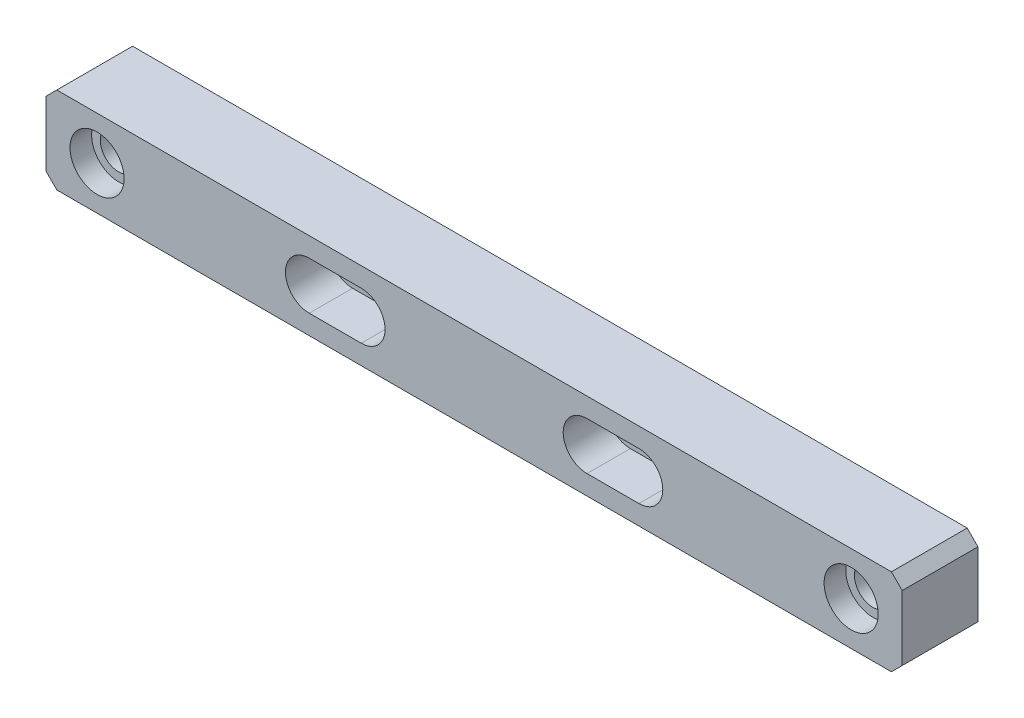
ISO-10303-21;
HEADER;
FILE_DESCRIPTION(('STEP AP214'),'2;1');
FILE_NAME('part.step','',(''),(''),'','','');
FILE_SCHEMA(('AUTOMOTIVE_DESIGN { 1 0 10303 214 1 1 1 1 }'));
ENDSEC;
DATA;
#1=APPLICATION_CONTEXT('core data for automotive mechanical design processes');
#2=APPLICATION_PROTOCOL_DEFINITION('international standard','automotive_design',2000,#1);
#3=PRODUCT_CONTEXT('',#1,'mechanical');
#4=PRODUCT('Part','Part','',(#3));
#5=PRODUCT_RELATED_PRODUCT_CATEGORY('part','',(#4));
#6=PRODUCT_DEFINITION_FORMATION('','',#4);
#7=PRODUCT_DEFINITION_CONTEXT('part definition',#1,'design');
#8=PRODUCT_DEFINITION('design','',#6,#7);
#9=PRODUCT_DEFINITION_SHAPE('','',#8);
#10=(LENGTH_UNIT() NAMED_UNIT(*) SI_UNIT(.MILLI.,.METRE.));
#11=(NAMED_UNIT(*) PLANE_ANGLE_UNIT() SI_UNIT($,.RADIAN.));
#12=(NAMED_UNIT(*) SI_UNIT($,.STERADIAN.) SOLID_ANGLE_UNIT());
#13=UNCERTAINTY_MEASURE_WITH_UNIT(LENGTH_MEASURE(1.E-05),#10,'distance_accuracy_value','');
#14=(GEOMETRIC_REPRESENTATION_CONTEXT(3) GLOBAL_UNCERTAINTY_ASSIGNED_CONTEXT((#13)) GLOBAL_UNIT_ASSIGNED_CONTEXT((#10,
#11,#12)) REPRESENTATION_CONTEXT('',''));
#15=CARTESIAN_POINT('',(0.,0.,0.));
#16=DIRECTION('',(0.,0.,1.));
#17=DIRECTION('',(1.,0.,0.));
#18=AXIS2_PLACEMENT_3D('',#15,#16,#17);
#19=CARTESIAN_POINT('',(68.9816494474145,-291.474223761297,91.585728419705));
#20=DIRECTION('',(-1.,0.,0.));
#21=DIRECTION('',(0.,0.,1.));
#22=AXIS2_PLACEMENT_3D('',#19,#20,#21);
#23=PLANE('',#22);
#24=DIRECTION('',(0.,-1.,0.));
#25=VECTOR('',#24,1.);
#26=CARTESIAN_POINT('',(68.9816494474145,-291.474223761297,126.585728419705));
#27=LINE('',#26,#25);
#28=CARTESIAN_POINT('',(68.9816494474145,-296.474223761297,126.585728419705));
#29=VERTEX_POINT('',#28);
#30=CARTESIAN_POINT('',(68.9816494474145,-326.474223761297,126.585728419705));
#31=VERTEX_POINT('',#30);
#32=EDGE_CURVE('E219',#29,#31,#27,.T.);
#33=ORIENTED_EDGE('',*,*,#32,.T.);
#34=DIRECTION('',(0.,0.,-1.));
#35=VECTOR('',#34,1.);
#36=CARTESIAN_POINT('',(68.9816494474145,-326.474223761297,91.585728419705));
#37=LINE('',#36,#35);
#38=CARTESIAN_POINT('',(68.9816494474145,-326.474223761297,91.585728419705));
#39=VERTEX_POINT('',#38);
#40=EDGE_CURVE('E11',#31,#39,#37,.T.);
#41=ORIENTED_EDGE('',*,*,#40,.T.);
#42=DIRECTION('',(0.,-1.,0.));
#43=VECTOR('',#42,1.);
#44=CARTESIAN_POINT('',(68.9816494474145,-291.474223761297,91.585728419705));
#45=LINE('',#44,#43);
#46=CARTESIAN_POINT('',(68.9816494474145,-296.474223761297,91.585728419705));
#47=VERTEX_POINT('',#46);
#48=EDGE_CURVE('E226',#47,#39,#45,.T.);
#49=ORIENTED_EDGE('',*,*,#48,.F.);
#50=DIRECTION('',(0.,0.,1.));
#51=VECTOR('',#50,1.);
#52=CARTESIAN_POINT('',(68.9816494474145,-296.474223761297,91.585728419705));
#53=LINE('',#52,#51);
#54=EDGE_CURVE('E41',#47,#29,#53,.T.);
#55=ORIENTED_EDGE('',*,*,#54,.T.);
#56=EDGE_LOOP('',(#33,#41,#49,#55));
#57=FACE_BOUND('',#56,.T.);
#58=ADVANCED_FACE('F33',(#57),#23,.F.);
#59=CARTESIAN_POINT('',(68.9816494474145,-331.474223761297,91.585728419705));
#60=DIRECTION('',(0.,1.,0.));
#61=DIRECTION('',(0.,0.,1.));
#62=AXIS2_PLACEMENT_3D('',#59,#60,#61);
#63=PLANE('',#62);
#64=DIRECTION('',(-1.,0.,0.));
#65=VECTOR('',#64,1.);
#66=CARTESIAN_POINT('',(68.9816494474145,-331.474223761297,126.585728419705));
#67=LINE('',#66,#65);
#68=CARTESIAN_POINT('',(63.9816494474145,-331.474223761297,126.585728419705));
#69=VERTEX_POINT('',#68);
#70=CARTESIAN_POINT('',(-321.422143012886,-331.474223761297,126.585728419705));
#71=VERTEX_POINT('',#70);
#72=EDGE_CURVE('E240',#69,#71,#67,.T.);
#73=ORIENTED_EDGE('',*,*,#72,.T.);
#74=DIRECTION('',(0.,0.,-1.));
#75=VECTOR('',#74,1.);
#76=CARTESIAN_POINT('',(-321.422143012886,-331.474223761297,91.585728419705));
#77=LINE('',#76,#75);
#78=CARTESIAN_POINT('',(-321.422143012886,-331.474223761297,91.585728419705));
#79=VERTEX_POINT('',#78);
#80=EDGE_CURVE('E268',#71,#79,#77,.T.);
#81=ORIENTED_EDGE('',*,*,#80,.T.);
#82=DIRECTION('',(-1.,0.,0.));
#83=VECTOR('',#82,1.);
#84=CARTESIAN_POINT('',(68.9816494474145,-331.474223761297,91.585728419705));
#85=LINE('',#84,#83);
#86=CARTESIAN_POINT('',(63.9816494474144,-331.474223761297,91.585728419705));
#87=VERTEX_POINT('',#86);
#88=EDGE_CURVE('E229',#87,#79,#85,.T.);
#89=ORIENTED_EDGE('',*,*,#88,.F.);
#90=DIRECTION('',(0.,0.,1.));
#91=VECTOR('',#90,1.);
#92=CARTESIAN_POINT('',(63.9816494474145,-331.474223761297,91.585728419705));
#93=LINE('',#92,#91);
#94=EDGE_CURVE('E265',#87,#69,#93,.T.);
#95=ORIENTED_EDGE('',*,*,#94,.T.);
#96=EDGE_LOOP('',(#73,#81,#89,#95));
#97=FACE_BOUND('',#96,.T.);
#98=ADVANCED_FACE('F299',(#97),#63,.F.);
#99=CARTESIAN_POINT('',(-326.422143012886,-291.474223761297,91.585728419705));
#100=DIRECTION('',(1.,0.,0.));
#101=DIRECTION('',(0.,0.,-1.));
#102=AXIS2_PLACEMENT_3D('',#99,#100,#101);
#103=PLANE('',#102);
#104=DIRECTION('',(0.,1.,0.));
#105=VECTOR('',#104,1.);
#106=CARTESIAN_POINT('',(-326.422143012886,-291.474223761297,91.585728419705));
#107=LINE('',#106,#105);
#108=CARTESIAN_POINT('',(-326.422143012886,-326.474223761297,91.585728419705));
#109=VERTEX_POINT('',#108);
#110=CARTESIAN_POINT('',(-326.422143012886,-296.474223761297,91.585728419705));
#111=VERTEX_POINT('',#110);
#112=EDGE_CURVE('E233',#109,#111,#107,.T.);
#113=ORIENTED_EDGE('',*,*,#112,.F.);
#114=DIRECTION('',(0.,0.,1.));
#115=VECTOR('',#114,1.);
#116=CARTESIAN_POINT('',(-326.422143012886,-326.474223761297,91.585728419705));
#117=LINE('',#116,#115);
#118=CARTESIAN_POINT('',(-326.422143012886,-326.474223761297,126.585728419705));
#119=VERTEX_POINT('',#118);
#120=EDGE_CURVE('E254',#109,#119,#117,.T.);
#121=ORIENTED_EDGE('',*,*,#120,.T.);
#122=DIRECTION('',(0.,1.,0.));
#123=VECTOR('',#122,1.);
#124=CARTESIAN_POINT('',(-326.422143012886,-291.474223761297,126.585728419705));
#125=LINE('',#124,#123);
#126=CARTESIAN_POINT('',(-326.422143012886,-296.474223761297,126.585728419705));
#127=VERTEX_POINT('',#126);
#128=EDGE_CURVE('E243',#119,#127,#125,.T.);
#129=ORIENTED_EDGE('',*,*,#128,.T.);
#130=DIRECTION('',(0.,0.,-1.));
#131=VECTOR('',#130,1.);
#132=CARTESIAN_POINT('',(-326.422143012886,-296.474223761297,91.585728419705));
#133=LINE('',#132,#131);
#134=EDGE_CURVE('E237',#127,#111,#133,.T.);
#135=ORIENTED_EDGE('',*,*,#134,.T.);
#136=EDGE_LOOP('',(#113,#121,#129,#135));
#137=FACE_BOUND('',#136,.T.);
#138=ADVANCED_FACE('F308',(#137),#103,.F.);
#139=CARTESIAN_POINT('',(68.9816494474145,-291.474223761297,91.585728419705));
#140=DIRECTION('',(0.,-1.,0.));
#141=DIRECTION('',(0.,0.,-1.));
#142=AXIS2_PLACEMENT_3D('',#139,#140,#141);
#143=PLANE('',#142);
#144=DIRECTION('',(1.,0.,0.));
#145=VECTOR('',#144,1.);
#146=CARTESIAN_POINT('',(68.9816494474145,-291.474223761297,91.585728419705));
#147=LINE('',#146,#145);
#148=CARTESIAN_POINT('',(-321.422143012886,-291.474223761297,91.585728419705));
#149=VERTEX_POINT('',#148);
#150=CARTESIAN_POINT('',(63.9816494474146,-291.474223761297,91.585728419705));
#151=VERTEX_POINT('',#150);
#152=EDGE_CURVE('E235',#149,#151,#147,.T.);
#153=ORIENTED_EDGE('',*,*,#152,.F.);
#154=DIRECTION('',(0.,0.,1.));
#155=VECTOR('',#154,1.);
#156=CARTESIAN_POINT('',(-321.422143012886,-291.474223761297,91.585728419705));
#157=LINE('',#156,#155);
#158=CARTESIAN_POINT('',(-321.422143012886,-291.474223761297,126.585728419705));
#159=VERTEX_POINT('',#158);
#160=EDGE_CURVE('E278',#149,#159,#157,.T.);
#161=ORIENTED_EDGE('',*,*,#160,.T.);
#162=DIRECTION('',(1.,0.,0.));
#163=VECTOR('',#162,1.);
#164=CARTESIAN_POINT('',(68.9816494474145,-291.474223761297,126.585728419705));
#165=LINE('',#164,#163);
#166=CARTESIAN_POINT('',(63.9816494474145,-291.474223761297,126.585728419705));
#167=VERTEX_POINT('',#166);
#168=EDGE_CURVE('E230',#159,#167,#165,.T.);
#169=ORIENTED_EDGE('',*,*,#168,.T.);
#170=DIRECTION('',(0.,0.,-1.));
#171=VECTOR('',#170,1.);
#172=CARTESIAN_POINT('',(63.9816494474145,-291.474223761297,91.585728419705));
#173=LINE('',#172,#171);
#174=EDGE_CURVE('E48',#167,#151,#173,.T.);
#175=ORIENTED_EDGE('',*,*,#174,.T.);
#176=EDGE_LOOP('',(#153,#161,#169,#175));
#177=FACE_BOUND('',#176,.T.);
#178=ADVANCED_FACE('F313',(#177),#143,.F.);
#179=CARTESIAN_POINT('',(0.,0.,91.585728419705));
#180=DIRECTION('',(0.,0.,-1.));
#181=DIRECTION('',(-1.,0.,0.));
#182=AXIS2_PLACEMENT_3D('',#179,#180,#181);
#183=PLANE('',#182);
#184=CARTESIAN_POINT('',(45.4097532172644,-311.474223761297,91.585728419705));
#185=DIRECTION('',(0.,0.,1.));
#186=DIRECTION('',(1.,0.,0.));
#187=AXIS2_PLACEMENT_3D('',#184,#185,#186);
#188=CIRCLE('',#187,8.5);
#189=CARTESIAN_POINT('',(53.9097532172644,-311.474223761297,91.585728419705));
#190=VERTEX_POINT('',#189);
#191=EDGE_CURVE('E603',#190,#190,#188,.T.);
#192=ORIENTED_EDGE('',*,*,#191,.T.);
#193=EDGE_LOOP('',(#192));
#194=FACE_BOUND('',#193,.T.);
#195=CARTESIAN_POINT('',(-302.850246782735,-311.474223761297,91.585728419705));
#196=DIRECTION('',(0.,0.,1.));
#197=DIRECTION('',(1.,0.,0.));
#198=AXIS2_PLACEMENT_3D('',#195,#196,#197);
#199=CIRCLE('',#198,8.50000000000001);
#200=CARTESIAN_POINT('',(-294.350246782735,-311.474223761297,91.585728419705));
#201=VERTEX_POINT('',#200);
#202=EDGE_CURVE('E597',#201,#201,#199,.T.);
#203=ORIENTED_EDGE('',*,*,#202,.T.);
#204=EDGE_LOOP('',(#203));
#205=FACE_BOUND('',#204,.T.);
#206=CARTESIAN_POINT('',(-192.850246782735,-311.474223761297,91.585728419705));
#207=DIRECTION('',(0.,0.,-1.));
#208=DIRECTION('',(-1.,0.,0.));
#209=AXIS2_PLACEMENT_3D('',#206,#207,#208);
#210=CIRCLE('',#209,8.50000000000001);
#211=CARTESIAN_POINT('',(-201.350246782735,-311.474223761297,91.585728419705));
#212=VERTEX_POINT('',#211);
#213=EDGE_CURVE('E252',#212,#212,#210,.T.);
#214=ORIENTED_EDGE('',*,*,#213,.F.);
#215=EDGE_LOOP('',(#214));
#216=FACE_BOUND('',#215,.T.);
#217=CARTESIAN_POINT('',(-64.5902467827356,-311.474223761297,91.585728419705));
#218=DIRECTION('',(0.,0.,-1.));
#219=DIRECTION('',(-1.,0.,0.));
#220=AXIS2_PLACEMENT_3D('',#217,#218,#219);
#221=CIRCLE('',#220,8.50000000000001);
#222=CARTESIAN_POINT('',(-73.0902467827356,-311.474223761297,91.585728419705));
#223=VERTEX_POINT('',#222);
#224=EDGE_CURVE('E177',#223,#223,#221,.T.);
#225=ORIENTED_EDGE('',*,*,#224,.F.);
#226=EDGE_LOOP('',(#225));
#227=FACE_BOUND('',#226,.T.);
#228=ORIENTED_EDGE('',*,*,#88,.T.);
#229=DIRECTION('',(0.707106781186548,-0.707106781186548,0.));
#230=VECTOR('',#229,1.);
#231=CARTESIAN_POINT('',(-326.448183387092,-326.448183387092,91.585728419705));
#232=LINE('',#231,#230);
#233=EDGE_CURVE('E275',#79,#109,#232,.F.);
#234=ORIENTED_EDGE('',*,*,#233,.T.);
#235=ORIENTED_EDGE('',*,*,#112,.T.);
#236=DIRECTION('',(-0.707106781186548,-0.707106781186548,0.));
#237=VECTOR('',#236,1.);
#238=CARTESIAN_POINT('',(-14.9739596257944,14.9739596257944,91.585728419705));
#239=LINE('',#238,#237);
#240=EDGE_CURVE('E55',#111,#149,#239,.F.);
#241=ORIENTED_EDGE('',*,*,#240,.T.);
#242=ORIENTED_EDGE('',*,*,#152,.T.);
#243=DIRECTION('',(-0.707106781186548,0.707106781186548,0.));
#244=VECTOR('',#243,1.);
#245=CARTESIAN_POINT('',(-113.746287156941,-113.746287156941,91.585728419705));
#246=LINE('',#245,#244);
#247=EDGE_CURVE('E270',#151,#47,#246,.F.);
#248=ORIENTED_EDGE('',*,*,#247,.T.);
#249=ORIENTED_EDGE('',*,*,#48,.T.);
#250=DIRECTION('',(0.707106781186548,0.707106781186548,0.));
#251=VECTOR('',#250,1.);
#252=CARTESIAN_POINT('',(197.727936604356,-197.727936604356,91.585728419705));
#253=LINE('',#252,#251);
#254=EDGE_CURVE('E272',#39,#87,#253,.F.);
#255=ORIENTED_EDGE('',*,*,#254,.T.);
#256=EDGE_LOOP('',(#228,#234,#235,#241,#242,#248,#249,#255));
#257=FACE_BOUND('',#256,.T.);
#258=ADVANCED_FACE('F302',(#194,#205,#216,#227,#257),#183,.T.);
#259=CARTESIAN_POINT('',(0.,0.,126.585728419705));
#260=DIRECTION('',(0.,0.,-1.));
#261=DIRECTION('',(-1.,0.,0.));
#262=AXIS2_PLACEMENT_3D('',#259,#260,#261);
#263=PLANE('',#262);
#264=CARTESIAN_POINT('',(45.4097532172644,-311.474223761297,126.585728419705));
#265=DIRECTION('',(0.,0.,1.));
#266=DIRECTION('',(1.,0.,0.));
#267=AXIS2_PLACEMENT_3D('',#264,#265,#266);
#268=CIRCLE('',#267,12.5);
#269=CARTESIAN_POINT('',(57.9097532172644,-311.474223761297,126.585728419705));
#270=VERTEX_POINT('',#269);
#271=EDGE_CURVE('E594',#270,#270,#268,.T.);
#272=ORIENTED_EDGE('',*,*,#271,.F.);
#273=EDGE_LOOP('',(#272));
#274=FACE_BOUND('',#273,.T.);
#275=CARTESIAN_POINT('',(-302.850246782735,-311.474223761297,126.585728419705));
#276=DIRECTION('',(0.,0.,1.));
#277=DIRECTION('',(1.,0.,0.));
#278=AXIS2_PLACEMENT_3D('',#275,#276,#277);
#279=CIRCLE('',#278,12.5);
#280=CARTESIAN_POINT('',(-290.350246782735,-311.474223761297,126.585728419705));
#281=VERTEX_POINT('',#280);
#282=EDGE_CURVE('E588',#281,#281,#279,.T.);
#283=ORIENTED_EDGE('',*,*,#282,.F.);
#284=EDGE_LOOP('',(#283));
#285=FACE_BOUND('',#284,.T.);
#286=DIRECTION('',(1.,0.,0.));
#287=VECTOR('',#286,1.);
#288=CARTESIAN_POINT('',(-76.5902467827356,-322.474223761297,126.585728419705));
#289=LINE('',#288,#287);
#290=CARTESIAN_POINT('',(-76.5902467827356,-322.474223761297,126.585728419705));
#291=VERTEX_POINT('',#290);
#292=CARTESIAN_POINT('',(-52.5902467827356,-322.474223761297,126.585728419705));
#293=VERTEX_POINT('',#292);
#294=EDGE_CURVE('E183',#291,#293,#289,.T.);
#295=ORIENTED_EDGE('',*,*,#294,.F.);
#296=CARTESIAN_POINT('',(-76.5902467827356,-311.474223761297,126.585728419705));
#297=DIRECTION('',(0.,0.,1.));
#298=DIRECTION('',(1.,0.,0.));
#299=AXIS2_PLACEMENT_3D('',#296,#297,#298);
#300=CIRCLE('',#299,11.);
#301=CARTESIAN_POINT('',(-76.5902467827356,-300.474223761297,126.585728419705));
#302=VERTEX_POINT('',#301);
#303=EDGE_CURVE('E154',#302,#291,#300,.T.);
#304=ORIENTED_EDGE('',*,*,#303,.F.);
#305=DIRECTION('',(-1.,0.,0.));
#306=VECTOR('',#305,1.);
#307=CARTESIAN_POINT('',(-76.5902467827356,-300.474223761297,126.585728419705));
#308=LINE('',#307,#306);
#309=CARTESIAN_POINT('',(-52.5902467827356,-300.474223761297,126.585728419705));
#310=VERTEX_POINT('',#309);
#311=EDGE_CURVE('E171',#310,#302,#308,.T.);
#312=ORIENTED_EDGE('',*,*,#311,.F.);
#313=CARTESIAN_POINT('',(-52.5902467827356,-311.474223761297,126.585728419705));
#314=DIRECTION('',(0.,0.,1.));
#315=DIRECTION('',(1.,0.,0.));
#316=AXIS2_PLACEMENT_3D('',#313,#314,#315);
#317=CIRCLE('',#316,11.);
#318=EDGE_CURVE('E174',#293,#310,#317,.T.);
#319=ORIENTED_EDGE('',*,*,#318,.F.);
#320=EDGE_LOOP('',(#295,#304,#312,#319));
#321=FACE_BOUND('',#320,.T.);
#322=DIRECTION('',(1.,0.,0.));
#323=VECTOR('',#322,1.);
#324=CARTESIAN_POINT('',(-204.850246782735,-322.474223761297,126.585728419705));
#325=LINE('',#324,#323);
#326=CARTESIAN_POINT('',(-204.850246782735,-322.474223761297,126.585728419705));
#327=VERTEX_POINT('',#326);
#328=CARTESIAN_POINT('',(-180.850246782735,-322.474223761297,126.585728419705));
#329=VERTEX_POINT('',#328);
#330=EDGE_CURVE('E209',#327,#329,#325,.T.);
#331=ORIENTED_EDGE('',*,*,#330,.F.);
#332=CARTESIAN_POINT('',(-204.850246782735,-311.474223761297,126.585728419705));
#333=DIRECTION('',(0.,0.,1.));
#334=DIRECTION('',(1.,0.,0.));
#335=AXIS2_PLACEMENT_3D('',#332,#333,#334);
#336=CIRCLE('',#335,11.);
#337=CARTESIAN_POINT('',(-204.850246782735,-300.474223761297,126.585728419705));
#338=VERTEX_POINT('',#337);
#339=EDGE_CURVE('E190',#338,#327,#336,.T.);
#340=ORIENTED_EDGE('',*,*,#339,.F.);
#341=DIRECTION('',(-1.,0.,0.));
#342=VECTOR('',#341,1.);
#343=CARTESIAN_POINT('',(-204.850246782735,-300.474223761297,126.585728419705));
#344=LINE('',#343,#342);
#345=CARTESIAN_POINT('',(-180.850246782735,-300.474223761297,126.585728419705));
#346=VERTEX_POINT('',#345);
#347=EDGE_CURVE('E198',#346,#338,#344,.T.);
#348=ORIENTED_EDGE('',*,*,#347,.F.);
#349=CARTESIAN_POINT('',(-180.850246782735,-311.474223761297,126.585728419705));
#350=DIRECTION('',(0.,0.,1.));
#351=DIRECTION('',(1.,0.,0.));
#352=AXIS2_PLACEMENT_3D('',#349,#350,#351);
#353=CIRCLE('',#352,11.);
#354=EDGE_CURVE('E212',#329,#346,#353,.T.);
#355=ORIENTED_EDGE('',*,*,#354,.F.);
#356=EDGE_LOOP('',(#331,#340,#348,#355));
#357=FACE_BOUND('',#356,.T.);
#358=ORIENTED_EDGE('',*,*,#128,.F.);
#359=DIRECTION('',(-0.707106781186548,0.707106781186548,0.));
#360=VECTOR('',#359,1.);
#361=CARTESIAN_POINT('',(-326.422143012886,-326.474223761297,126.585728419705));
#362=LINE('',#361,#360);
#363=EDGE_CURVE('E263',#119,#71,#362,.F.);
#364=ORIENTED_EDGE('',*,*,#363,.T.);
#365=ORIENTED_EDGE('',*,*,#72,.F.);
#366=DIRECTION('',(-0.707106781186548,-0.707106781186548,0.));
#367=VECTOR('',#366,1.);
#368=CARTESIAN_POINT('',(63.9816494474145,-331.474223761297,126.585728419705));
#369=LINE('',#368,#367);
#370=EDGE_CURVE('E259',#69,#31,#369,.F.);
#371=ORIENTED_EDGE('',*,*,#370,.T.);
#372=ORIENTED_EDGE('',*,*,#32,.F.);
#373=DIRECTION('',(0.707106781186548,-0.707106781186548,0.));
#374=VECTOR('',#373,1.);
#375=CARTESIAN_POINT('',(68.9816494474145,-296.474223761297,126.585728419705));
#376=LINE('',#375,#374);
#377=EDGE_CURVE('E257',#29,#167,#376,.F.);
#378=ORIENTED_EDGE('',*,*,#377,.T.);
#379=ORIENTED_EDGE('',*,*,#168,.F.);
#380=DIRECTION('',(0.707106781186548,0.707106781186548,0.));
#381=VECTOR('',#380,1.);
#382=CARTESIAN_POINT('',(-321.422143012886,-291.474223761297,126.585728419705));
#383=LINE('',#382,#381);
#384=EDGE_CURVE('E261',#159,#127,#383,.F.);
#385=ORIENTED_EDGE('',*,*,#384,.T.);
#386=EDGE_LOOP('',(#358,#364,#365,#371,#372,#378,#379,#385));
#387=FACE_BOUND('',#386,.T.);
#388=ADVANCED_FACE('F290',(#274,#285,#321,#357,#387),#263,.F.);
#389=CARTESIAN_POINT('',(-204.850246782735,-311.474223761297,106.585728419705));
#390=DIRECTION('',(0.,0.,1.));
#391=DIRECTION('',(1.,0.,0.));
#392=AXIS2_PLACEMENT_3D('',#389,#390,#391);
#393=CYLINDRICAL_SURFACE('',#392,11.);
#394=ORIENTED_EDGE('',*,*,#339,.T.);
#395=DIRECTION('',(0.,0.,1.));
#396=VECTOR('',#395,1.);
#397=CARTESIAN_POINT('',(-204.850246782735,-322.474223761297,106.585728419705));
#398=LINE('',#397,#396);
#399=CARTESIAN_POINT('',(-204.850246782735,-322.474223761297,106.585728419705));
#400=VERTEX_POINT('',#399);
#401=EDGE_CURVE('E207',#400,#327,#398,.T.);
#402=ORIENTED_EDGE('',*,*,#401,.F.);
#403=CARTESIAN_POINT('',(-204.850246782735,-311.474223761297,106.585728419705));
#404=DIRECTION('',(0.,0.,1.));
#405=DIRECTION('',(1.,0.,0.));
#406=AXIS2_PLACEMENT_3D('',#403,#404,#405);
#407=CIRCLE('',#406,11.);
#408=CARTESIAN_POINT('',(-204.850246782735,-300.474223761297,106.585728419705));
#409=VERTEX_POINT('',#408);
#410=EDGE_CURVE('E194',#409,#400,#407,.T.);
#411=ORIENTED_EDGE('',*,*,#410,.F.);
#412=DIRECTION('',(0.,0.,1.));
#413=VECTOR('',#412,1.);
#414=CARTESIAN_POINT('',(-204.850246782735,-300.474223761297,106.585728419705));
#415=LINE('',#414,#413);
#416=EDGE_CURVE('E217',#409,#338,#415,.T.);
#417=ORIENTED_EDGE('',*,*,#416,.T.);
#418=EDGE_LOOP('',(#394,#402,#411,#417));
#419=FACE_BOUND('',#418,.T.);
#420=ADVANCED_FACE('F358',(#419),#393,.F.);
#421=CARTESIAN_POINT('',(-204.850246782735,-300.474223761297,106.585728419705));
#422=DIRECTION('',(0.,1.,0.));
#423=DIRECTION('',(0.,0.,1.));
#424=AXIS2_PLACEMENT_3D('',#421,#422,#423);
#425=PLANE('',#424);
#426=ORIENTED_EDGE('',*,*,#347,.T.);
#427=ORIENTED_EDGE('',*,*,#416,.F.);
#428=DIRECTION('',(-1.,0.,0.));
#429=VECTOR('',#428,1.);
#430=CARTESIAN_POINT('',(-204.850246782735,-300.474223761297,106.585728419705));
#431=LINE('',#430,#429);
#432=CARTESIAN_POINT('',(-180.850246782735,-300.474223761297,106.585728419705));
#433=VERTEX_POINT('',#432);
#434=EDGE_CURVE('E204',#433,#409,#431,.T.);
#435=ORIENTED_EDGE('',*,*,#434,.F.);
#436=DIRECTION('',(0.,0.,1.));
#437=VECTOR('',#436,1.);
#438=CARTESIAN_POINT('',(-180.850246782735,-300.474223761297,106.585728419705));
#439=LINE('',#438,#437);
#440=EDGE_CURVE('E220',#433,#346,#439,.T.);
#441=ORIENTED_EDGE('',*,*,#440,.T.);
#442=EDGE_LOOP('',(#426,#427,#435,#441));
#443=FACE_BOUND('',#442,.T.);
#444=ADVANCED_FACE('F459',(#443),#425,.F.);
#445=CARTESIAN_POINT('',(-180.850246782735,-311.474223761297,106.585728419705));
#446=DIRECTION('',(0.,0.,1.));
#447=DIRECTION('',(1.,0.,0.));
#448=AXIS2_PLACEMENT_3D('',#445,#446,#447);
#449=CYLINDRICAL_SURFACE('',#448,11.);
#450=ORIENTED_EDGE('',*,*,#354,.T.);
#451=ORIENTED_EDGE('',*,*,#440,.F.);
#452=CARTESIAN_POINT('',(-180.850246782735,-311.474223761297,106.585728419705));
#453=DIRECTION('',(0.,0.,1.));
#454=DIRECTION('',(1.,0.,0.));
#455=AXIS2_PLACEMENT_3D('',#452,#453,#454);
#456=CIRCLE('',#455,11.);
#457=CARTESIAN_POINT('',(-180.850246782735,-322.474223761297,106.585728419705));
#458=VERTEX_POINT('',#457);
#459=EDGE_CURVE('E201',#458,#433,#456,.T.);
#460=ORIENTED_EDGE('',*,*,#459,.F.);
#461=DIRECTION('',(0.,0.,1.));
#462=VECTOR('',#461,1.);
#463=CARTESIAN_POINT('',(-180.850246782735,-322.474223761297,106.585728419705));
#464=LINE('',#463,#462);
#465=EDGE_CURVE('E222',#458,#329,#464,.T.);
#466=ORIENTED_EDGE('',*,*,#465,.T.);
#467=EDGE_LOOP('',(#450,#451,#460,#466));
#468=FACE_BOUND('',#467,.T.);
#469=ADVANCED_FACE('F462',(#468),#449,.F.);
#470=CARTESIAN_POINT('',(-204.850246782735,-322.474223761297,106.585728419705));
#471=DIRECTION('',(0.,-1.,0.));
#472=DIRECTION('',(0.,0.,-1.));
#473=AXIS2_PLACEMENT_3D('',#470,#471,#472);
#474=PLANE('',#473);
#475=ORIENTED_EDGE('',*,*,#330,.T.);
#476=ORIENTED_EDGE('',*,*,#465,.F.);
#477=DIRECTION('',(1.,0.,0.));
#478=VECTOR('',#477,1.);
#479=CARTESIAN_POINT('',(-204.850246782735,-322.474223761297,106.585728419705));
#480=LINE('',#479,#478);
#481=EDGE_CURVE('E197',#400,#458,#480,.T.);
#482=ORIENTED_EDGE('',*,*,#481,.F.);
#483=ORIENTED_EDGE('',*,*,#401,.T.);
#484=EDGE_LOOP('',(#475,#476,#482,#483));
#485=FACE_BOUND('',#484,.T.);
#486=ADVANCED_FACE('F457',(#485),#474,.F.);
#487=CARTESIAN_POINT('',(-204.850246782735,-311.474223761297,106.585728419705));
#488=DIRECTION('',(0.,0.,1.));
#489=DIRECTION('',(1.,0.,0.));
#490=AXIS2_PLACEMENT_3D('',#487,#488,#489);
#491=PLANE('',#490);
#492=CARTESIAN_POINT('',(-192.850246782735,-311.474223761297,106.585728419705));
#493=DIRECTION('',(0.,0.,1.));
#494=DIRECTION('',(1.,0.,0.));
#495=AXIS2_PLACEMENT_3D('',#492,#493,#494);
#496=CIRCLE('',#495,8.50000000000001);
#497=CARTESIAN_POINT('',(-184.350246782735,-311.474223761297,106.585728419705));
#498=VERTEX_POINT('',#497);
#499=EDGE_CURVE('E249',#498,#498,#496,.T.);
#500=ORIENTED_EDGE('',*,*,#499,.F.);
#501=EDGE_LOOP('',(#500));
#502=FACE_BOUND('',#501,.T.);
#503=ORIENTED_EDGE('',*,*,#410,.T.);
#504=ORIENTED_EDGE('',*,*,#481,.T.);
#505=ORIENTED_EDGE('',*,*,#459,.T.);
#506=ORIENTED_EDGE('',*,*,#434,.T.);
#507=EDGE_LOOP('',(#503,#504,#505,#506));
#508=FACE_BOUND('',#507,.T.);
#509=ADVANCED_FACE('F454',(#502,#508),#491,.T.);
#510=CARTESIAN_POINT('',(-76.5902467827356,-311.474223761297,106.585728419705));
#511=DIRECTION('',(0.,0.,1.));
#512=DIRECTION('',(1.,0.,0.));
#513=AXIS2_PLACEMENT_3D('',#510,#511,#512);
#514=CYLINDRICAL_SURFACE('',#513,11.);
#515=ORIENTED_EDGE('',*,*,#303,.T.);
#516=DIRECTION('',(0.,0.,1.));
#517=VECTOR('',#516,1.);
#518=CARTESIAN_POINT('',(-76.5902467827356,-322.474223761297,106.585728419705));
#519=LINE('',#518,#517);
#520=CARTESIAN_POINT('',(-76.5902467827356,-322.474223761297,106.585728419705));
#521=VERTEX_POINT('',#520);
#522=EDGE_CURVE('E147',#521,#291,#519,.T.);
#523=ORIENTED_EDGE('',*,*,#522,.F.);
#524=CARTESIAN_POINT('',(-76.5902467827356,-311.474223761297,106.585728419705));
#525=DIRECTION('',(0.,0.,1.));
#526=DIRECTION('',(1.,0.,0.));
#527=AXIS2_PLACEMENT_3D('',#524,#525,#526);
#528=CIRCLE('',#527,11.);
#529=CARTESIAN_POINT('',(-76.5902467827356,-300.474223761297,106.585728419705));
#530=VERTEX_POINT('',#529);
#531=EDGE_CURVE('E151',#530,#521,#528,.T.);
#532=ORIENTED_EDGE('',*,*,#531,.F.);
#533=DIRECTION('',(0.,0.,1.));
#534=VECTOR('',#533,1.);
#535=CARTESIAN_POINT('',(-76.5902467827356,-300.474223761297,106.585728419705));
#536=LINE('',#535,#534);
#537=EDGE_CURVE('E188',#530,#302,#536,.T.);
#538=ORIENTED_EDGE('',*,*,#537,.T.);
#539=EDGE_LOOP('',(#515,#523,#532,#538));
#540=FACE_BOUND('',#539,.T.);
#541=ADVANCED_FACE('F149',(#540),#514,.F.);
#542=CARTESIAN_POINT('',(-76.5902467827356,-300.474223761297,106.585728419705));
#543=DIRECTION('',(0.,1.,0.));
#544=DIRECTION('',(0.,0.,1.));
#545=AXIS2_PLACEMENT_3D('',#542,#543,#544);
#546=PLANE('',#545);
#547=ORIENTED_EDGE('',*,*,#311,.T.);
#548=ORIENTED_EDGE('',*,*,#537,.F.);
#549=DIRECTION('',(-1.,0.,0.));
#550=VECTOR('',#549,1.);
#551=CARTESIAN_POINT('',(-76.5902467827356,-300.474223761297,106.585728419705));
#552=LINE('',#551,#550);
#553=CARTESIAN_POINT('',(-52.5902467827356,-300.474223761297,106.585728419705));
#554=VERTEX_POINT('',#553);
#555=EDGE_CURVE('E159',#554,#530,#552,.T.);
#556=ORIENTED_EDGE('',*,*,#555,.F.);
#557=DIRECTION('',(0.,0.,1.));
#558=VECTOR('',#557,1.);
#559=CARTESIAN_POINT('',(-52.5902467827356,-300.474223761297,106.585728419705));
#560=LINE('',#559,#558);
#561=EDGE_CURVE('E191',#554,#310,#560,.T.);
#562=ORIENTED_EDGE('',*,*,#561,.T.);
#563=EDGE_LOOP('',(#547,#548,#556,#562));
#564=FACE_BOUND('',#563,.T.);
#565=ADVANCED_FACE('F442',(#564),#546,.F.);
#566=CARTESIAN_POINT('',(-52.5902467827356,-311.474223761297,106.585728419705));
#567=DIRECTION('',(0.,0.,1.));
#568=DIRECTION('',(1.,0.,0.));
#569=AXIS2_PLACEMENT_3D('',#566,#567,#568);
#570=CYLINDRICAL_SURFACE('',#569,11.);
#571=ORIENTED_EDGE('',*,*,#318,.T.);
#572=ORIENTED_EDGE('',*,*,#561,.F.);
#573=CARTESIAN_POINT('',(-52.5902467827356,-311.474223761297,106.585728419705));
#574=DIRECTION('',(0.,0.,1.));
#575=DIRECTION('',(1.,0.,0.));
#576=AXIS2_PLACEMENT_3D('',#573,#574,#575);
#577=CIRCLE('',#576,11.);
#578=CARTESIAN_POINT('',(-52.5902467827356,-322.474223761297,106.585728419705));
#579=VERTEX_POINT('',#578);
#580=EDGE_CURVE('E167',#579,#554,#577,.T.);
#581=ORIENTED_EDGE('',*,*,#580,.F.);
#582=DIRECTION('',(0.,0.,1.));
#583=VECTOR('',#582,1.);
#584=CARTESIAN_POINT('',(-52.5902467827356,-322.474223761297,106.585728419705));
#585=LINE('',#584,#583);
#586=EDGE_CURVE('E158',#579,#293,#585,.T.);
#587=ORIENTED_EDGE('',*,*,#586,.T.);
#588=EDGE_LOOP('',(#571,#572,#581,#587));
#589=FACE_BOUND('',#588,.T.);
#590=ADVANCED_FACE('F445',(#589),#570,.F.);
#591=CARTESIAN_POINT('',(-76.5902467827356,-322.474223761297,106.585728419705));
#592=DIRECTION('',(0.,-1.,0.));
#593=DIRECTION('',(0.,0.,-1.));
#594=AXIS2_PLACEMENT_3D('',#591,#592,#593);
#595=PLANE('',#594);
#596=ORIENTED_EDGE('',*,*,#294,.T.);
#597=ORIENTED_EDGE('',*,*,#586,.F.);
#598=DIRECTION('',(1.,0.,0.));
#599=VECTOR('',#598,1.);
#600=CARTESIAN_POINT('',(-76.5902467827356,-322.474223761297,106.585728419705));
#601=LINE('',#600,#599);
#602=EDGE_CURVE('E162',#521,#579,#601,.T.);
#603=ORIENTED_EDGE('',*,*,#602,.F.);
#604=ORIENTED_EDGE('',*,*,#522,.T.);
#605=EDGE_LOOP('',(#596,#597,#603,#604));
#606=FACE_BOUND('',#605,.T.);
#607=ADVANCED_FACE('F163',(#606),#595,.F.);
#608=CARTESIAN_POINT('',(-76.5902467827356,-311.474223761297,106.585728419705));
#609=DIRECTION('',(0.,0.,1.));
#610=DIRECTION('',(1.,0.,0.));
#611=AXIS2_PLACEMENT_3D('',#608,#609,#610);
#612=PLANE('',#611);
#613=CARTESIAN_POINT('',(-64.5902467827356,-311.474223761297,106.585728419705));
#614=DIRECTION('',(0.,0.,1.));
#615=DIRECTION('',(1.,0.,0.));
#616=AXIS2_PLACEMENT_3D('',#613,#614,#615);
#617=CIRCLE('',#616,8.50000000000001);
#618=CARTESIAN_POINT('',(-56.0902467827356,-311.474223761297,106.585728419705));
#619=VERTEX_POINT('',#618);
#620=EDGE_CURVE('E184',#619,#619,#617,.T.);
#621=ORIENTED_EDGE('',*,*,#620,.F.);
#622=EDGE_LOOP('',(#621));
#623=FACE_BOUND('',#622,.T.);
#624=ORIENTED_EDGE('',*,*,#531,.T.);
#625=ORIENTED_EDGE('',*,*,#602,.T.);
#626=ORIENTED_EDGE('',*,*,#580,.T.);
#627=ORIENTED_EDGE('',*,*,#555,.T.);
#628=EDGE_LOOP('',(#624,#625,#626,#627));
#629=FACE_BOUND('',#628,.T.);
#630=ADVANCED_FACE('F169',(#623,#629),#612,.T.);
#631=CARTESIAN_POINT('',(-64.5902467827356,-311.474223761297,126.585728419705));
#632=DIRECTION('',(0.,0.,-1.));
#633=DIRECTION('',(-1.,0.,0.));
#634=AXIS2_PLACEMENT_3D('',#631,#632,#633);
#635=CYLINDRICAL_SURFACE('',#634,8.50000000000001);
#636=ORIENTED_EDGE('',*,*,#620,.T.);
#637=EDGE_LOOP('',(#636));
#638=FACE_BOUND('',#637,.T.);
#639=ORIENTED_EDGE('',*,*,#224,.T.);
#640=EDGE_LOOP('',(#639));
#641=FACE_BOUND('',#640,.T.);
#642=ADVANCED_FACE('F434',(#638,#641),#635,.F.);
#643=CARTESIAN_POINT('',(-192.850246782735,-311.474223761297,126.585728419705));
#644=DIRECTION('',(0.,0.,-1.));
#645=DIRECTION('',(-1.,0.,0.));
#646=AXIS2_PLACEMENT_3D('',#643,#644,#645);
#647=CYLINDRICAL_SURFACE('',#646,8.50000000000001);
#648=ORIENTED_EDGE('',*,*,#499,.T.);
#649=EDGE_LOOP('',(#648));
#650=FACE_BOUND('',#649,.T.);
#651=ORIENTED_EDGE('',*,*,#213,.T.);
#652=EDGE_LOOP('',(#651));
#653=FACE_BOUND('',#652,.T.);
#654=ADVANCED_FACE('F333',(#650,#653),#647,.F.);
#655=CARTESIAN_POINT('',(-326.422143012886,-326.474223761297,91.585728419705));
#656=DIRECTION('',(0.707106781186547,0.707106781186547,0.));
#657=DIRECTION('',(0.,0.,1.));
#658=AXIS2_PLACEMENT_3D('',#655,#656,#657);
#659=PLANE('',#658);
#660=ORIENTED_EDGE('',*,*,#233,.F.);
#661=ORIENTED_EDGE('',*,*,#80,.F.);
#662=ORIENTED_EDGE('',*,*,#363,.F.);
#663=ORIENTED_EDGE('',*,*,#120,.F.);
#664=EDGE_LOOP('',(#660,#661,#662,#663));
#665=FACE_BOUND('',#664,.T.);
#666=ADVANCED_FACE('F306',(#665),#659,.F.);
#667=CARTESIAN_POINT('',(-321.422143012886,-291.474223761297,91.585728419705));
#668=DIRECTION('',(0.707106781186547,-0.707106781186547,0.));
#669=DIRECTION('',(0.,0.,1.));
#670=AXIS2_PLACEMENT_3D('',#667,#668,#669);
#671=PLANE('',#670);
#672=ORIENTED_EDGE('',*,*,#240,.F.);
#673=ORIENTED_EDGE('',*,*,#134,.F.);
#674=ORIENTED_EDGE('',*,*,#384,.F.);
#675=ORIENTED_EDGE('',*,*,#160,.F.);
#676=EDGE_LOOP('',(#672,#673,#674,#675));
#677=FACE_BOUND('',#676,.T.);
#678=ADVANCED_FACE('F312',(#677),#671,.F.);
#679=CARTESIAN_POINT('',(63.9816494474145,-331.474223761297,91.585728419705));
#680=DIRECTION('',(-0.707106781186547,0.707106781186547,0.));
#681=DIRECTION('',(0.,0.,1.));
#682=AXIS2_PLACEMENT_3D('',#679,#680,#681);
#683=PLANE('',#682);
#684=ORIENTED_EDGE('',*,*,#254,.F.);
#685=ORIENTED_EDGE('',*,*,#40,.F.);
#686=ORIENTED_EDGE('',*,*,#370,.F.);
#687=ORIENTED_EDGE('',*,*,#94,.F.);
#688=EDGE_LOOP('',(#684,#685,#686,#687));
#689=FACE_BOUND('',#688,.T.);
#690=ADVANCED_FACE('F296',(#689),#683,.F.);
#691=CARTESIAN_POINT('',(68.9816494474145,-296.474223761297,91.585728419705));
#692=DIRECTION('',(-0.707106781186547,-0.707106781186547,0.));
#693=DIRECTION('',(0.,0.,1.));
#694=AXIS2_PLACEMENT_3D('',#691,#692,#693);
#695=PLANE('',#694);
#696=ORIENTED_EDGE('',*,*,#247,.F.);
#697=ORIENTED_EDGE('',*,*,#174,.F.);
#698=ORIENTED_EDGE('',*,*,#377,.F.);
#699=ORIENTED_EDGE('',*,*,#54,.F.);
#700=EDGE_LOOP('',(#696,#697,#698,#699));
#701=FACE_BOUND('',#700,.T.);
#702=ADVANCED_FACE('F35',(#701),#695,.F.);
#703=CARTESIAN_POINT('',(-302.850246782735,-311.474223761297,116.585728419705));
#704=DIRECTION('',(0.,0.,1.));
#705=DIRECTION('',(1.,0.,0.));
#706=AXIS2_PLACEMENT_3D('',#703,#704,#705);
#707=CYLINDRICAL_SURFACE('',#706,12.5);
#708=CARTESIAN_POINT('',(-302.850246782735,-311.474223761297,116.585728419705));
#709=DIRECTION('',(0.,0.,1.));
#710=DIRECTION('',(1.,0.,0.));
#711=AXIS2_PLACEMENT_3D('',#708,#709,#710);
#712=CIRCLE('',#711,12.5);
#713=CARTESIAN_POINT('',(-290.350246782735,-311.474223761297,116.585728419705));
#714=VERTEX_POINT('',#713);
#715=EDGE_CURVE('E586',#714,#714,#712,.T.);
#716=ORIENTED_EDGE('',*,*,#715,.F.);
#717=EDGE_LOOP('',(#716));
#718=FACE_BOUND('',#717,.T.);
#719=ORIENTED_EDGE('',*,*,#282,.T.);
#720=EDGE_LOOP('',(#719));
#721=FACE_BOUND('',#720,.T.);
#722=ADVANCED_FACE('F315',(#718,#721),#707,.F.);
#723=CARTESIAN_POINT('',(-302.850246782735,-311.474223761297,116.585728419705));
#724=DIRECTION('',(0.,0.,1.));
#725=DIRECTION('',(1.,0.,0.));
#726=AXIS2_PLACEMENT_3D('',#723,#724,#725);
#727=PLANE('',#726);
#728=CARTESIAN_POINT('',(-302.850246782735,-311.474223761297,116.585728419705));
#729=DIRECTION('',(0.,0.,1.));
#730=DIRECTION('',(1.,0.,0.));
#731=AXIS2_PLACEMENT_3D('',#728,#729,#730);
#732=CIRCLE('',#731,8.50000000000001);
#733=CARTESIAN_POINT('',(-294.350246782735,-311.474223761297,116.585728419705));
#734=VERTEX_POINT('',#733);
#735=EDGE_CURVE('E600',#734,#734,#732,.T.);
#736=ORIENTED_EDGE('',*,*,#735,.F.);
#737=EDGE_LOOP('',(#736));
#738=FACE_BOUND('',#737,.T.);
#739=ORIENTED_EDGE('',*,*,#715,.T.);
#740=EDGE_LOOP('',(#739));
#741=FACE_BOUND('',#740,.T.);
#742=ADVANCED_FACE('F320',(#738,#741),#727,.T.);
#743=CARTESIAN_POINT('',(45.4097532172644,-311.474223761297,116.585728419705));
#744=DIRECTION('',(0.,0.,1.));
#745=DIRECTION('',(1.,0.,0.));
#746=AXIS2_PLACEMENT_3D('',#743,#744,#745);
#747=CYLINDRICAL_SURFACE('',#746,12.5);
#748=CARTESIAN_POINT('',(45.4097532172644,-311.474223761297,116.585728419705));
#749=DIRECTION('',(0.,0.,1.));
#750=DIRECTION('',(1.,0.,0.));
#751=AXIS2_PLACEMENT_3D('',#748,#749,#750);
#752=CIRCLE('',#751,12.5);
#753=CARTESIAN_POINT('',(57.9097532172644,-311.474223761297,116.585728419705));
#754=VERTEX_POINT('',#753);
#755=EDGE_CURVE('E592',#754,#754,#752,.T.);
#756=ORIENTED_EDGE('',*,*,#755,.F.);
#757=EDGE_LOOP('',(#756));
#758=FACE_BOUND('',#757,.T.);
#759=ORIENTED_EDGE('',*,*,#271,.T.);
#760=EDGE_LOOP('',(#759));
#761=FACE_BOUND('',#760,.T.);
#762=ADVANCED_FACE('F375',(#758,#761),#747,.F.);
#763=CARTESIAN_POINT('',(45.4097532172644,-311.474223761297,116.585728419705));
#764=DIRECTION('',(0.,0.,1.));
#765=DIRECTION('',(1.,0.,0.));
#766=AXIS2_PLACEMENT_3D('',#763,#764,#765);
#767=PLANE('',#766);
#768=CARTESIAN_POINT('',(45.4097532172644,-311.474223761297,116.585728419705));
#769=DIRECTION('',(0.,0.,1.));
#770=DIRECTION('',(1.,0.,0.));
#771=AXIS2_PLACEMENT_3D('',#768,#769,#770);
#772=CIRCLE('',#771,8.5);
#773=CARTESIAN_POINT('',(53.9097532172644,-311.474223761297,116.585728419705));
#774=VERTEX_POINT('',#773);
#775=EDGE_CURVE('E606',#774,#774,#772,.T.);
#776=ORIENTED_EDGE('',*,*,#775,.F.);
#777=EDGE_LOOP('',(#776));
#778=FACE_BOUND('',#777,.T.);
#779=ORIENTED_EDGE('',*,*,#755,.T.);
#780=EDGE_LOOP('',(#779));
#781=FACE_BOUND('',#780,.T.);
#782=ADVANCED_FACE('F380',(#778,#781),#767,.T.);
#783=CARTESIAN_POINT('',(-302.850246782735,-311.474223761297,91.585728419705));
#784=DIRECTION('',(0.,0.,1.));
#785=DIRECTION('',(1.,0.,0.));
#786=AXIS2_PLACEMENT_3D('',#783,#784,#785);
#787=CYLINDRICAL_SURFACE('',#786,8.50000000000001);
#788=ORIENTED_EDGE('',*,*,#202,.F.);
#789=EDGE_LOOP('',(#788));
#790=FACE_BOUND('',#789,.T.);
#791=ORIENTED_EDGE('',*,*,#735,.T.);
#792=EDGE_LOOP('',(#791));
#793=FACE_BOUND('',#792,.T.);
#794=ADVANCED_FACE('F406',(#790,#793),#787,.F.);
#795=CARTESIAN_POINT('',(45.4097532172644,-311.474223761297,91.585728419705));
#796=DIRECTION('',(0.,0.,1.));
#797=DIRECTION('',(1.,0.,0.));
#798=AXIS2_PLACEMENT_3D('',#795,#796,#797);
#799=CYLINDRICAL_SURFACE('',#798,8.5);
#800=ORIENTED_EDGE('',*,*,#191,.F.);
#801=EDGE_LOOP('',(#800));
#802=FACE_BOUND('',#801,.T.);
#803=ORIENTED_EDGE('',*,*,#775,.T.);
#804=EDGE_LOOP('',(#803));
#805=FACE_BOUND('',#804,.T.);
#806=ADVANCED_FACE('F416',(#802,#805),#799,.F.);
#807=CLOSED_SHELL('',(#58,#98,#138,#178,#258,#388,#420,#444,#469,#486,#509,#541,#565,#590,#607,
#630,#642,#654,#666,#678,#690,#702,#722,#742,#762,#782,#794,#806));
#808=MANIFOLD_SOLID_BREP('B2',#807);
#809=ADVANCED_BREP_SHAPE_REPRESENTATION('',(#18,#808),#14);
#810=SHAPE_DEFINITION_REPRESENTATION(#9,#809);
ENDSEC;
END-ISO-10303-21;
